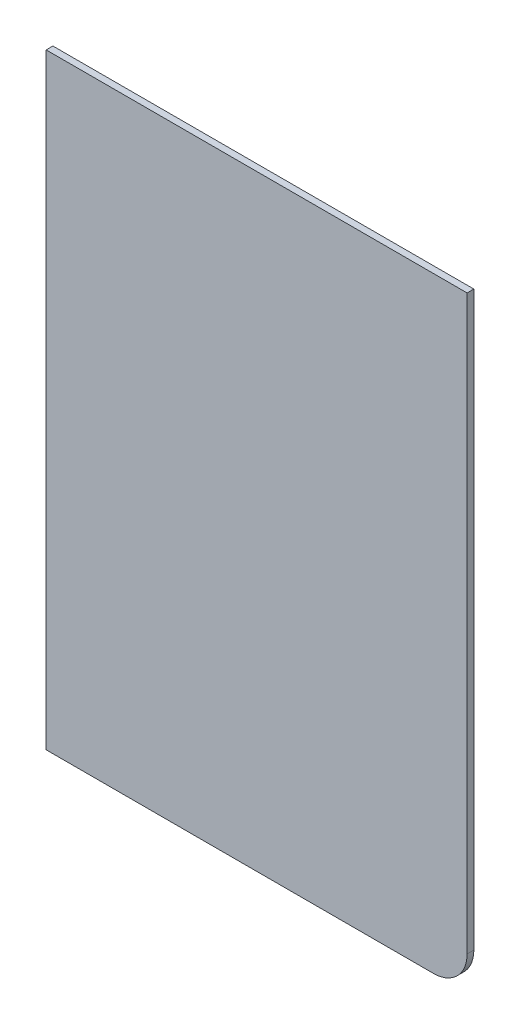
from build123d import *

# Parameters (mm, degrees)
ESQUISSE1_W      = 125
ESQUISSE1_H      = 180
EXTRUSION1_DEPTH = 2
CONG_1_R         = 10


with BuildPart() as part:
    # Esquisse1 → Extrusion1 (new body)
    with BuildSketch(Plane.XY):
        with Locations((62.5, 90)):
            Rectangle(ESQUISSE1_W, ESQUISSE1_H)
    extrude(amount=EXTRUSION1_DEPTH)

    # Cong_1
    cong_1_edges = [part.edges().sort_by_distance(p)[0] for p in [
        (125, 0, 1),
    ]]
    fillet(cong_1_edges, radius=CONG_1_R)


solid = part.part
